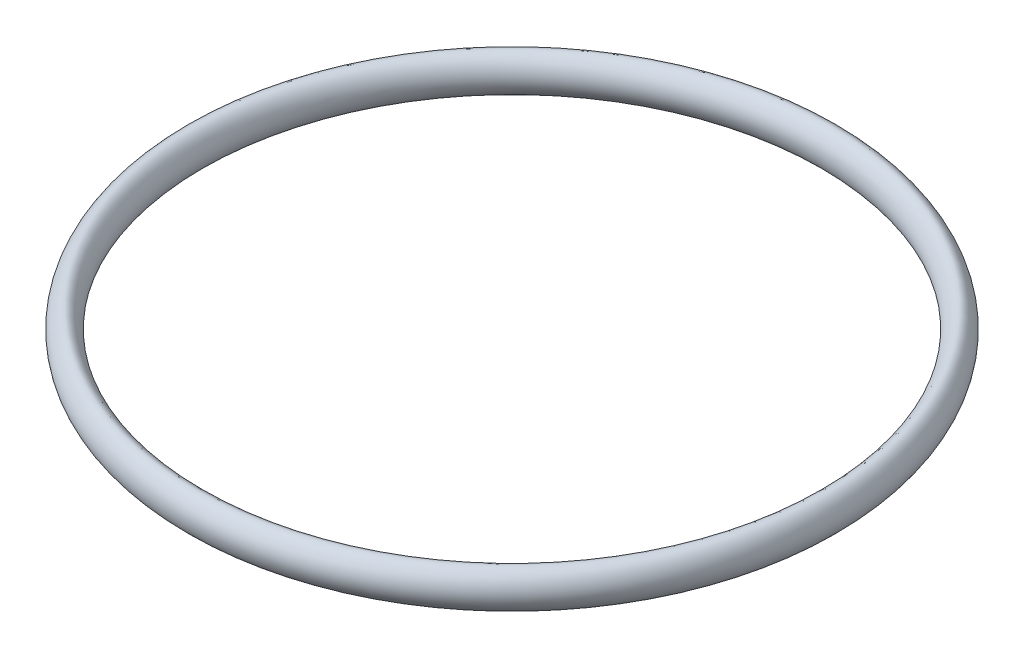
ISO-10303-21;
HEADER;
FILE_DESCRIPTION(('STEP AP214'),'2;1');
FILE_NAME('part.step','',(''),(''),'','','');
FILE_SCHEMA(('AUTOMOTIVE_DESIGN { 1 0 10303 214 1 1 1 1 }'));
ENDSEC;
DATA;
#1=APPLICATION_CONTEXT('core data for automotive mechanical design processes');
#2=APPLICATION_PROTOCOL_DEFINITION('international standard','automotive_design',2000,#1);
#3=PRODUCT_CONTEXT('',#1,'mechanical');
#4=PRODUCT('Part','Part','',(#3));
#5=PRODUCT_RELATED_PRODUCT_CATEGORY('part','',(#4));
#6=PRODUCT_DEFINITION_FORMATION('','',#4);
#7=PRODUCT_DEFINITION_CONTEXT('part definition',#1,'design');
#8=PRODUCT_DEFINITION('design','',#6,#7);
#9=PRODUCT_DEFINITION_SHAPE('','',#8);
#10=(LENGTH_UNIT() NAMED_UNIT(*) SI_UNIT(.MILLI.,.METRE.));
#11=(NAMED_UNIT(*) PLANE_ANGLE_UNIT() SI_UNIT($,.RADIAN.));
#12=(NAMED_UNIT(*) SI_UNIT($,.STERADIAN.) SOLID_ANGLE_UNIT());
#13=UNCERTAINTY_MEASURE_WITH_UNIT(LENGTH_MEASURE(1.E-05),#10,'distance_accuracy_value','');
#14=(GEOMETRIC_REPRESENTATION_CONTEXT(3) GLOBAL_UNCERTAINTY_ASSIGNED_CONTEXT((#13)) GLOBAL_UNIT_ASSIGNED_CONTEXT((#10,
#11,#12)) REPRESENTATION_CONTEXT('',''));
#15=CARTESIAN_POINT('',(0.,0.,0.));
#16=DIRECTION('',(0.,0.,1.));
#17=DIRECTION('',(1.,0.,0.));
#18=AXIS2_PLACEMENT_3D('',#15,#16,#17);
#19=CARTESIAN_POINT('',(-55.18,3.305,0.));
#20=CARTESIAN_POINT('',(-56.34,3.305,0.));
#21=CARTESIAN_POINT('',(-58.66,0.,0.));
#22=CARTESIAN_POINT('',(-55.18,-4.9575,0.));
#23=CARTESIAN_POINT('',(-51.7,0.,0.));
#24=CARTESIAN_POINT('',(-54.02,3.305,0.));
#25=CARTESIAN_POINT('',(-55.18,3.305,0.));
#26=B_SPLINE_CURVE_WITH_KNOTS('',3,(#19,#20,#21,#22,#23,#24,#25),.UNSPECIFIED.,.T.,.F.,(4,1,1,1,
4),(0.,0.25,0.5,0.75,1.),.UNSPECIFIED.);
#27=CARTESIAN_POINT('',(0.,0.,0.));
#28=DIRECTION('',(0.,-1.,0.));
#29=AXIS1_PLACEMENT('',#27,#28);
#30=SURFACE_OF_REVOLUTION('',#26,#29);
#31=ADVANCED_FACE('F40',(),#30,.T.);
#32=CLOSED_SHELL('',(#31));
#33=MANIFOLD_SOLID_BREP('B2',#32);
#34=ADVANCED_BREP_SHAPE_REPRESENTATION('',(#18,#33),#14);
#35=SHAPE_DEFINITION_REPRESENTATION(#9,#34);
ENDSEC;
END-ISO-10303-21;
